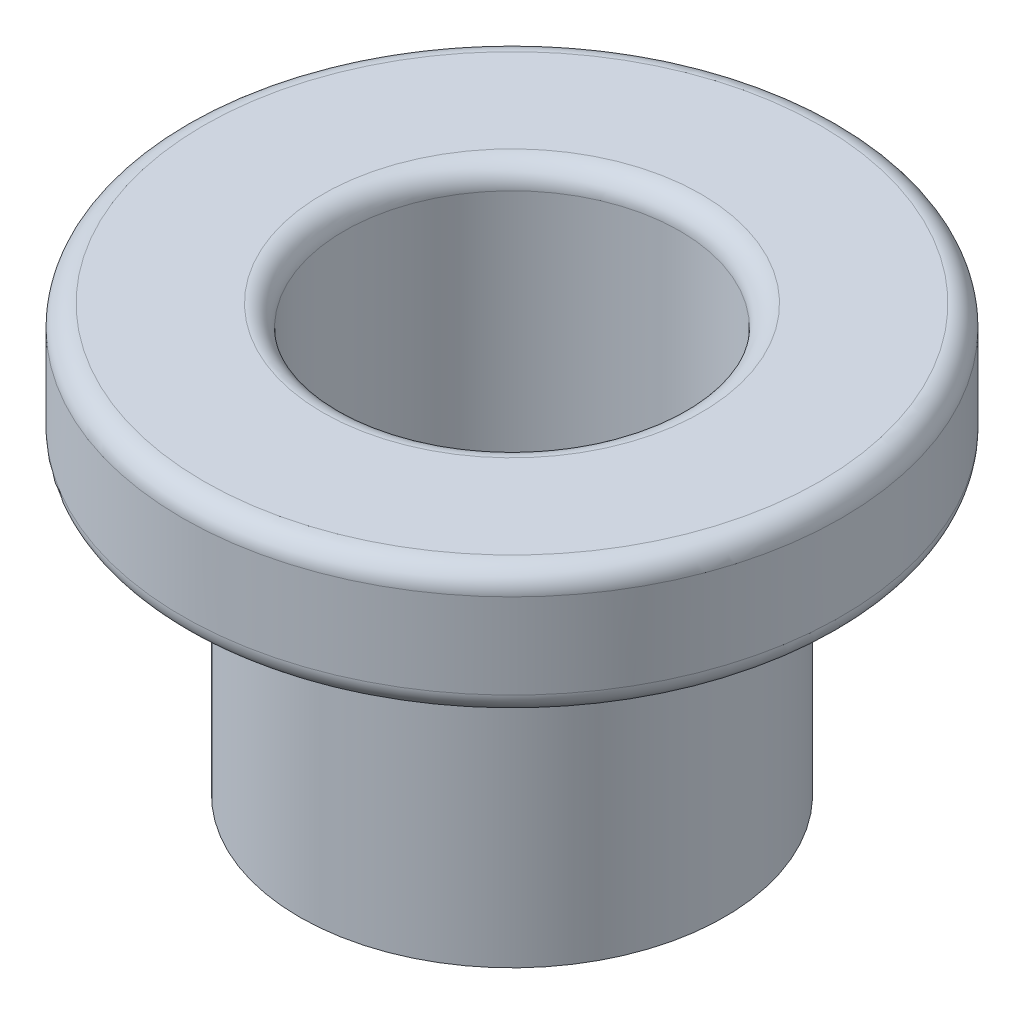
ISO-10303-21;
HEADER;
FILE_DESCRIPTION(('STEP AP214'),'2;1');
FILE_NAME('part.step','',(''),(''),'','','');
FILE_SCHEMA(('AUTOMOTIVE_DESIGN { 1 0 10303 214 1 1 1 1 }'));
ENDSEC;
DATA;
#1=APPLICATION_CONTEXT('core data for automotive mechanical design processes');
#2=APPLICATION_PROTOCOL_DEFINITION('international standard','automotive_design',2000,#1);
#3=PRODUCT_CONTEXT('',#1,'mechanical');
#4=PRODUCT('Part','Part','',(#3));
#5=PRODUCT_RELATED_PRODUCT_CATEGORY('part','',(#4));
#6=PRODUCT_DEFINITION_FORMATION('','',#4);
#7=PRODUCT_DEFINITION_CONTEXT('part definition',#1,'design');
#8=PRODUCT_DEFINITION('design','',#6,#7);
#9=PRODUCT_DEFINITION_SHAPE('','',#8);
#10=(LENGTH_UNIT() NAMED_UNIT(*) SI_UNIT(.MILLI.,.METRE.));
#11=(NAMED_UNIT(*) PLANE_ANGLE_UNIT() SI_UNIT($,.RADIAN.));
#12=(NAMED_UNIT(*) SI_UNIT($,.STERADIAN.) SOLID_ANGLE_UNIT());
#13=UNCERTAINTY_MEASURE_WITH_UNIT(LENGTH_MEASURE(1.E-05),#10,'distance_accuracy_value','');
#14=(GEOMETRIC_REPRESENTATION_CONTEXT(3) GLOBAL_UNCERTAINTY_ASSIGNED_CONTEXT((#13)) GLOBAL_UNIT_ASSIGNED_CONTEXT((#10,
#11,#12)) REPRESENTATION_CONTEXT('',''));
#15=CARTESIAN_POINT('',(0.,0.,0.));
#16=DIRECTION('',(0.,0.,1.));
#17=DIRECTION('',(1.,0.,0.));
#18=AXIS2_PLACEMENT_3D('',#15,#16,#17);
#19=CARTESIAN_POINT('',(2.54,0.,0.));
#20=DIRECTION('',(0.,-1.,0.));
#21=DIRECTION('',(0.,0.,-1.));
#22=AXIS2_PLACEMENT_3D('',#19,#20,#21);
#23=PLANE('',#22);
#24=CARTESIAN_POINT('',(0.,0.,0.));
#25=DIRECTION('',(0.,-1.,0.));
#26=DIRECTION('',(0.,0.,-1.));
#27=AXIS2_PLACEMENT_3D('',#24,#25,#26);
#28=CIRCLE('',#27,2.54);
#29=CARTESIAN_POINT('',(0.,0.,-2.54));
#30=VERTEX_POINT('',#29);
#31=EDGE_CURVE('E55',#30,#30,#28,.T.);
#32=ORIENTED_EDGE('',*,*,#31,.T.);
#33=EDGE_LOOP('',(#32));
#34=FACE_BOUND('',#33,.T.);
#35=CARTESIAN_POINT('',(0.,0.,0.));
#36=DIRECTION('',(0.,-1.,0.));
#37=DIRECTION('',(0.,0.,-1.));
#38=AXIS2_PLACEMENT_3D('',#35,#36,#37);
#39=CIRCLE('',#38,2.0066);
#40=CARTESIAN_POINT('',(0.,0.,-2.0066));
#41=VERTEX_POINT('',#40);
#42=EDGE_CURVE('E49',#41,#41,#39,.T.);
#43=ORIENTED_EDGE('',*,*,#42,.F.);
#44=EDGE_LOOP('',(#43));
#45=FACE_BOUND('',#44,.T.);
#46=ADVANCED_FACE('F24',(#34,#45),#23,.T.);
#47=CARTESIAN_POINT('',(0.,0.,0.));
#48=DIRECTION('',(0.,-1.,0.));
#49=DIRECTION('',(0.,0.,-1.));
#50=AXIS2_PLACEMENT_3D('',#47,#48,#49);
#51=CYLINDRICAL_SURFACE('',#50,2.0066);
#52=CARTESIAN_POINT('',(0.,4.826,0.));
#53=DIRECTION('',(0.,1.,0.));
#54=DIRECTION('',(0.,0.,1.));
#55=AXIS2_PLACEMENT_3D('',#52,#53,#54);
#56=CIRCLE('',#55,2.0066);
#57=CARTESIAN_POINT('',(0.,4.826,2.0066));
#58=VERTEX_POINT('',#57);
#59=EDGE_CURVE('E38',#58,#58,#56,.T.);
#60=ORIENTED_EDGE('',*,*,#59,.T.);
#61=EDGE_LOOP('',(#60));
#62=FACE_BOUND('',#61,.T.);
#63=ORIENTED_EDGE('',*,*,#42,.T.);
#64=EDGE_LOOP('',(#63));
#65=FACE_BOUND('',#64,.T.);
#66=ADVANCED_FACE('F79',(#62,#65),#51,.F.);
#67=CARTESIAN_POINT('',(2.0066,5.08,0.));
#68=DIRECTION('',(0.,1.,0.));
#69=DIRECTION('',(0.,0.,1.));
#70=AXIS2_PLACEMENT_3D('',#67,#68,#69);
#71=PLANE('',#70);
#72=CARTESIAN_POINT('',(0.,5.08,0.));
#73=DIRECTION('',(0.,1.,0.));
#74=DIRECTION('',(0.,0.,1.));
#75=AXIS2_PLACEMENT_3D('',#72,#73,#74);
#76=CIRCLE('',#75,2.2606);
#77=CARTESIAN_POINT('',(0.,5.08,2.2606));
#78=VERTEX_POINT('',#77);
#79=EDGE_CURVE('E43',#78,#78,#76,.F.);
#80=ORIENTED_EDGE('',*,*,#79,.T.);
#81=EDGE_LOOP('',(#80));
#82=FACE_BOUND('',#81,.T.);
#83=CARTESIAN_POINT('',(0.,5.08,0.));
#84=DIRECTION('',(0.,1.,0.));
#85=DIRECTION('',(0.,0.,1.));
#86=AXIS2_PLACEMENT_3D('',#83,#84,#85);
#87=CIRCLE('',#86,3.683);
#88=CARTESIAN_POINT('',(0.,5.08,3.683));
#89=VERTEX_POINT('',#88);
#90=EDGE_CURVE('E46',#89,#89,#87,.T.);
#91=ORIENTED_EDGE('',*,*,#90,.T.);
#92=EDGE_LOOP('',(#91));
#93=FACE_BOUND('',#92,.T.);
#94=ADVANCED_FACE('F82',(#82,#93),#71,.T.);
#95=CARTESIAN_POINT('',(0.,0.,0.));
#96=DIRECTION('',(0.,-1.,0.));
#97=DIRECTION('',(0.,0.,-1.));
#98=AXIS2_PLACEMENT_3D('',#95,#96,#97);
#99=CYLINDRICAL_SURFACE('',#98,3.937);
#100=CARTESIAN_POINT('',(0.,3.81,0.));
#101=DIRECTION('',(0.,-1.,0.));
#102=DIRECTION('',(0.,0.,-1.));
#103=AXIS2_PLACEMENT_3D('',#100,#101,#102);
#104=CIRCLE('',#103,3.937);
#105=CARTESIAN_POINT('',(0.,3.81,-3.937));
#106=VERTEX_POINT('',#105);
#107=EDGE_CURVE('E10',#106,#106,#104,.F.);
#108=ORIENTED_EDGE('',*,*,#107,.T.);
#109=EDGE_LOOP('',(#108));
#110=FACE_BOUND('',#109,.T.);
#111=CARTESIAN_POINT('',(0.,4.826,0.));
#112=DIRECTION('',(0.,1.,0.));
#113=DIRECTION('',(0.,0.,1.));
#114=AXIS2_PLACEMENT_3D('',#111,#112,#113);
#115=CIRCLE('',#114,3.937);
#116=CARTESIAN_POINT('',(0.,4.826,3.937));
#117=VERTEX_POINT('',#116);
#118=EDGE_CURVE('E30',#117,#117,#115,.F.);
#119=ORIENTED_EDGE('',*,*,#118,.T.);
#120=EDGE_LOOP('',(#119));
#121=FACE_BOUND('',#120,.T.);
#122=ADVANCED_FACE('F76',(#110,#121),#99,.T.);
#123=CARTESIAN_POINT('',(3.937,3.556,0.));
#124=DIRECTION('',(0.,-1.,0.));
#125=DIRECTION('',(0.,0.,-1.));
#126=AXIS2_PLACEMENT_3D('',#123,#124,#125);
#127=PLANE('',#126);
#128=CARTESIAN_POINT('',(0.,3.556,0.));
#129=DIRECTION('',(0.,-1.,0.));
#130=DIRECTION('',(0.,0.,-1.));
#131=AXIS2_PLACEMENT_3D('',#128,#129,#130);
#132=CIRCLE('',#131,3.683);
#133=CARTESIAN_POINT('',(0.,3.556,-3.683));
#134=VERTEX_POINT('',#133);
#135=EDGE_CURVE('E34',#134,#134,#132,.T.);
#136=ORIENTED_EDGE('',*,*,#135,.T.);
#137=EDGE_LOOP('',(#136));
#138=FACE_BOUND('',#137,.T.);
#139=CARTESIAN_POINT('',(0.,3.556,0.));
#140=DIRECTION('',(0.,-1.,0.));
#141=DIRECTION('',(0.,0.,-1.));
#142=AXIS2_PLACEMENT_3D('',#139,#140,#141);
#143=CIRCLE('',#142,2.54);
#144=CARTESIAN_POINT('',(0.,3.556,-2.54));
#145=VERTEX_POINT('',#144);
#146=EDGE_CURVE('E52',#145,#145,#143,.T.);
#147=ORIENTED_EDGE('',*,*,#146,.F.);
#148=EDGE_LOOP('',(#147));
#149=FACE_BOUND('',#148,.T.);
#150=ADVANCED_FACE('F64',(#138,#149),#127,.T.);
#151=CARTESIAN_POINT('',(0.,0.,0.));
#152=DIRECTION('',(0.,-1.,0.));
#153=DIRECTION('',(0.,0.,-1.));
#154=AXIS2_PLACEMENT_3D('',#151,#152,#153);
#155=CYLINDRICAL_SURFACE('',#154,2.54);
#156=ORIENTED_EDGE('',*,*,#146,.T.);
#157=EDGE_LOOP('',(#156));
#158=FACE_BOUND('',#157,.T.);
#159=ORIENTED_EDGE('',*,*,#31,.F.);
#160=EDGE_LOOP('',(#159));
#161=FACE_BOUND('',#160,.T.);
#162=ADVANCED_FACE('F61',(#158,#161),#155,.T.);
#163=CARTESIAN_POINT('',(0.,4.826,0.));
#164=DIRECTION('',(0.,1.,0.));
#165=DIRECTION('',(0.,0.,1.));
#166=AXIS2_PLACEMENT_3D('',#163,#164,#165);
#167=TOROIDAL_SURFACE('',#166,2.2606,0.254);
#168=ORIENTED_EDGE('',*,*,#59,.F.);
#169=EDGE_LOOP('',(#168));
#170=FACE_BOUND('',#169,.T.);
#171=ORIENTED_EDGE('',*,*,#79,.F.);
#172=EDGE_LOOP('',(#171));
#173=FACE_BOUND('',#172,.T.);
#174=ADVANCED_FACE('F63',(#170,#173),#167,.T.);
#175=CARTESIAN_POINT('',(0.,3.81,0.));
#176=DIRECTION('',(0.,-1.,0.));
#177=DIRECTION('',(0.,0.,-1.));
#178=AXIS2_PLACEMENT_3D('',#175,#176,#177);
#179=TOROIDAL_SURFACE('',#178,3.683,0.254);
#180=ORIENTED_EDGE('',*,*,#107,.F.);
#181=EDGE_LOOP('',(#180));
#182=FACE_BOUND('',#181,.T.);
#183=ORIENTED_EDGE('',*,*,#135,.F.);
#184=EDGE_LOOP('',(#183));
#185=FACE_BOUND('',#184,.T.);
#186=ADVANCED_FACE('F72',(#182,#185),#179,.T.);
#187=CARTESIAN_POINT('',(0.,4.826,0.));
#188=DIRECTION('',(0.,1.,0.));
#189=DIRECTION('',(0.,0.,1.));
#190=AXIS2_PLACEMENT_3D('',#187,#188,#189);
#191=TOROIDAL_SURFACE('',#190,3.683,0.254);
#192=ORIENTED_EDGE('',*,*,#90,.F.);
#193=EDGE_LOOP('',(#192));
#194=FACE_BOUND('',#193,.T.);
#195=ORIENTED_EDGE('',*,*,#118,.F.);
#196=EDGE_LOOP('',(#195));
#197=FACE_BOUND('',#196,.T.);
#198=ADVANCED_FACE('F110',(#194,#197),#191,.T.);
#199=CLOSED_SHELL('',(#46,#66,#94,#122,#150,#162,#174,#186,#198));
#200=MANIFOLD_SOLID_BREP('B2',#199);
#201=ADVANCED_BREP_SHAPE_REPRESENTATION('',(#18,#200),#14);
#202=SHAPE_DEFINITION_REPRESENTATION(#9,#201);
ENDSEC;
END-ISO-10303-21;
